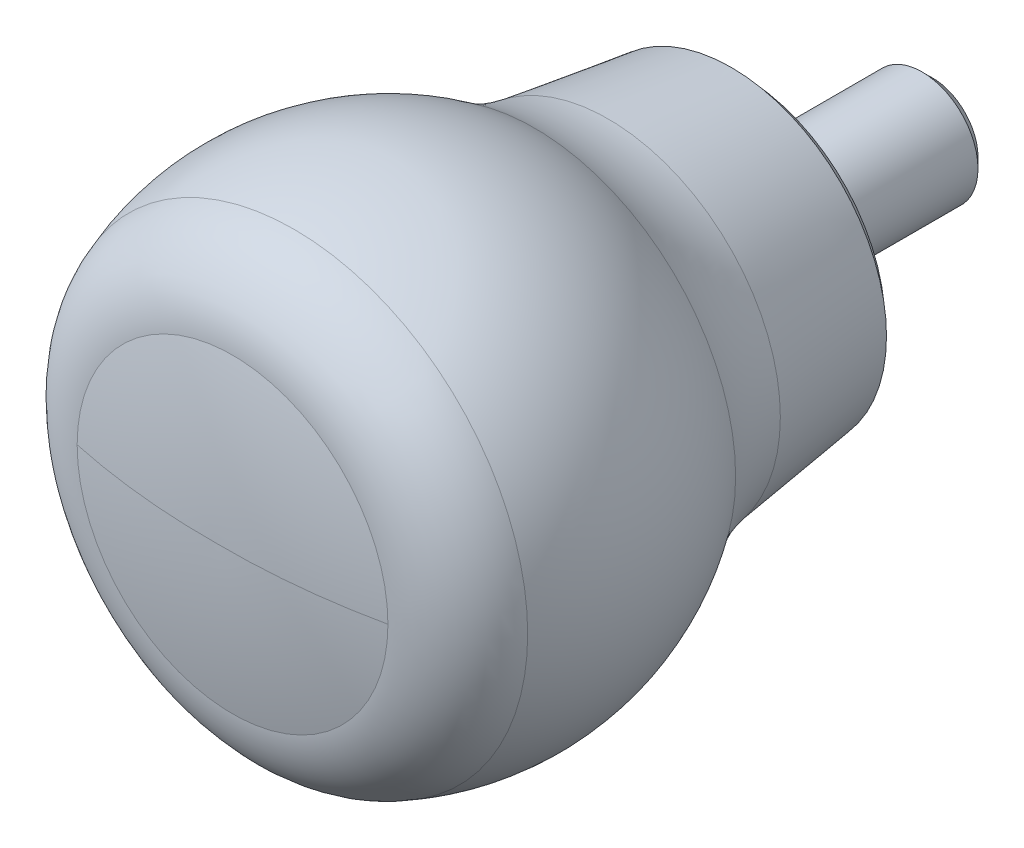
ISO-10303-21;
HEADER;
FILE_DESCRIPTION(('STEP AP214'),'2;1');
FILE_NAME('part.step','',(''),(''),'','','');
FILE_SCHEMA(('AUTOMOTIVE_DESIGN { 1 0 10303 214 1 1 1 1 }'));
ENDSEC;
DATA;
#1=APPLICATION_CONTEXT('core data for automotive mechanical design processes');
#2=APPLICATION_PROTOCOL_DEFINITION('international standard','automotive_design',2000,#1);
#3=PRODUCT_CONTEXT('',#1,'mechanical');
#4=PRODUCT('Part','Part','',(#3));
#5=PRODUCT_RELATED_PRODUCT_CATEGORY('part','',(#4));
#6=PRODUCT_DEFINITION_FORMATION('','',#4);
#7=PRODUCT_DEFINITION_CONTEXT('part definition',#1,'design');
#8=PRODUCT_DEFINITION('design','',#6,#7);
#9=PRODUCT_DEFINITION_SHAPE('','',#8);
#10=(LENGTH_UNIT() NAMED_UNIT(*) SI_UNIT(.MILLI.,.METRE.));
#11=(NAMED_UNIT(*) PLANE_ANGLE_UNIT() SI_UNIT($,.RADIAN.));
#12=(NAMED_UNIT(*) SI_UNIT($,.STERADIAN.) SOLID_ANGLE_UNIT());
#13=UNCERTAINTY_MEASURE_WITH_UNIT(LENGTH_MEASURE(1.E-05),#10,'distance_accuracy_value','');
#14=(GEOMETRIC_REPRESENTATION_CONTEXT(3) GLOBAL_UNCERTAINTY_ASSIGNED_CONTEXT((#13)) GLOBAL_UNIT_ASSIGNED_CONTEXT((#10,
#11,#12)) REPRESENTATION_CONTEXT('',''));
#15=CARTESIAN_POINT('',(0.,0.,0.));
#16=DIRECTION('',(0.,0.,1.));
#17=DIRECTION('',(1.,0.,0.));
#18=AXIS2_PLACEMENT_3D('',#15,#16,#17);
#19=CARTESIAN_POINT('',(0.,2.04,-17.));
#20=DIRECTION('',(0.,0.,-1.));
#21=DIRECTION('',(-1.,0.,0.));
#22=AXIS2_PLACEMENT_3D('',#19,#20,#21);
#23=PLANE('',#22);
#24=DIRECTION('',(0.866025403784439,0.5,0.));
#25=VECTOR('',#24,1.);
#26=CARTESIAN_POINT('',(-2.5,1.4433756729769,-17.));
#27=LINE('',#26,#25);
#28=CARTESIAN_POINT('',(-2.5,1.4433756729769,-17.));
#29=VERTEX_POINT('',#28);
#30=CARTESIAN_POINT('',(0.,2.88675134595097,-17.));
#31=VERTEX_POINT('',#30);
#32=EDGE_CURVE('E30',#29,#31,#27,.T.);
#33=ORIENTED_EDGE('',*,*,#32,.F.);
#34=DIRECTION('',(0.,1.,0.));
#35=VECTOR('',#34,1.);
#36=CARTESIAN_POINT('',(-2.5,-1.44337567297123,-17.));
#37=LINE('',#36,#35);
#38=CARTESIAN_POINT('',(-2.5,-1.44337567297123,-17.));
#39=VERTEX_POINT('',#38);
#40=EDGE_CURVE('E129',#39,#29,#37,.T.);
#41=ORIENTED_EDGE('',*,*,#40,.F.);
#42=DIRECTION('',(-0.866025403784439,0.5,0.));
#43=VECTOR('',#42,1.);
#44=CARTESIAN_POINT('',(0.,-2.88675134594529,-17.));
#45=LINE('',#44,#43);
#46=CARTESIAN_POINT('',(0.,-2.88675134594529,-17.));
#47=VERTEX_POINT('',#46);
#48=EDGE_CURVE('E127',#47,#39,#45,.T.);
#49=ORIENTED_EDGE('',*,*,#48,.F.);
#50=DIRECTION('',(-0.866025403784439,-0.5,0.));
#51=VECTOR('',#50,1.);
#52=CARTESIAN_POINT('',(2.5,-1.44337567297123,-17.));
#53=LINE('',#52,#51);
#54=CARTESIAN_POINT('',(2.5,-1.44337567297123,-17.));
#55=VERTEX_POINT('',#54);
#56=EDGE_CURVE('E96',#55,#47,#53,.T.);
#57=ORIENTED_EDGE('',*,*,#56,.F.);
#58=DIRECTION('',(0.,-1.,0.));
#59=VECTOR('',#58,1.);
#60=CARTESIAN_POINT('',(2.5,1.4433756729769,-17.));
#61=LINE('',#60,#59);
#62=CARTESIAN_POINT('',(2.5,1.4433756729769,-17.));
#63=VERTEX_POINT('',#62);
#64=EDGE_CURVE('E123',#63,#55,#61,.T.);
#65=ORIENTED_EDGE('',*,*,#64,.F.);
#66=DIRECTION('',(0.866025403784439,-0.5,0.));
#67=VECTOR('',#66,1.);
#68=CARTESIAN_POINT('',(0.,2.88675134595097,-17.));
#69=LINE('',#68,#67);
#70=EDGE_CURVE('E120',#31,#63,#69,.T.);
#71=ORIENTED_EDGE('',*,*,#70,.F.);
#72=EDGE_LOOP('',(#33,#41,#49,#57,#65,#71));
#73=FACE_BOUND('',#72,.T.);
#74=CARTESIAN_POINT('',(0.,0.,-17.));
#75=DIRECTION('',(0.,0.,1.));
#76=DIRECTION('',(1.,0.,0.));
#77=AXIS2_PLACEMENT_3D('',#74,#75,#76);
#78=CIRCLE('',#77,4.08000000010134);
#79=CARTESIAN_POINT('',(4.08000000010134,0.,-17.));
#80=VERTEX_POINT('',#79);
#81=EDGE_CURVE('E17',#80,#80,#78,.T.);
#82=ORIENTED_EDGE('',*,*,#81,.F.);
#83=EDGE_LOOP('',(#82));
#84=FACE_BOUND('',#83,.T.);
#85=ADVANCED_FACE('F14',(#73,#84),#23,.T.);
#86=CARTESIAN_POINT('',(0.,0.,-16.0800000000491));
#87=DIRECTION('',(0.,0.,1.));
#88=DIRECTION('',(1.,0.,0.));
#89=AXIS2_PLACEMENT_3D('',#86,#87,#88);
#90=CONICAL_SURFACE('',#89,5.0000000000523,0.785398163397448);
#91=ORIENTED_EDGE('',*,*,#81,.T.);
#92=EDGE_LOOP('',(#91));
#93=FACE_BOUND('',#92,.T.);
#94=CARTESIAN_POINT('',(0.,0.,-16.08));
#95=DIRECTION('',(0.,0.,1.));
#96=DIRECTION('',(1.,0.,0.));
#97=AXIS2_PLACEMENT_3D('',#94,#95,#96);
#98=CIRCLE('',#97,5.);
#99=CARTESIAN_POINT('',(5.,0.,-16.08));
#100=VERTEX_POINT('',#99);
#101=EDGE_CURVE('E198',#100,#100,#98,.T.);
#102=ORIENTED_EDGE('',*,*,#101,.F.);
#103=EDGE_LOOP('',(#102));
#104=FACE_BOUND('',#103,.T.);
#105=ADVANCED_FACE('F223',(#93,#104),#90,.T.);
#106=CARTESIAN_POINT('',(0.,0.,-9.5));
#107=DIRECTION('',(0.,0.,1.));
#108=DIRECTION('',(1.,0.,0.));
#109=AXIS2_PLACEMENT_3D('',#106,#107,#108);
#110=CYLINDRICAL_SURFACE('',#109,5.);
#111=ORIENTED_EDGE('',*,*,#101,.T.);
#112=EDGE_LOOP('',(#111));
#113=FACE_BOUND('',#112,.T.);
#114=CARTESIAN_POINT('',(0.,0.,-2.91999999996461));
#115=DIRECTION('',(0.,0.,-1.));
#116=DIRECTION('',(0.,1.,0.));
#117=AXIS2_PLACEMENT_3D('',#114,#115,#116);
#118=CIRCLE('',#117,4.99999999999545);
#119=CARTESIAN_POINT('',(0.,4.99999999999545,-2.91999999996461));
#120=VERTEX_POINT('',#119);
#121=EDGE_CURVE('E195',#120,#120,#118,.F.);
#122=ORIENTED_EDGE('',*,*,#121,.F.);
#123=EDGE_LOOP('',(#122));
#124=FACE_BOUND('',#123,.T.);
#125=ADVANCED_FACE('F218',(#113,#124),#110,.T.);
#126=CARTESIAN_POINT('',(0.,0.,-2.91999999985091));
#127=DIRECTION('',(0.,0.,-1.));
#128=DIRECTION('',(-1.,0.,0.));
#129=AXIS2_PLACEMENT_3D('',#126,#127,#128);
#130=CONICAL_SURFACE('',#129,4.99999999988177,0.785398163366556);
#131=ORIENTED_EDGE('',*,*,#121,.T.);
#132=EDGE_LOOP('',(#131));
#133=FACE_BOUND('',#132,.T.);
#134=CARTESIAN_POINT('',(0.,0.,-2.));
#135=DIRECTION('',(0.,0.,1.));
#136=DIRECTION('',(1.,0.,0.));
#137=AXIS2_PLACEMENT_3D('',#134,#135,#136);
#138=CIRCLE('',#137,4.08);
#139=CARTESIAN_POINT('',(4.08,0.,-2.));
#140=VERTEX_POINT('',#139);
#141=EDGE_CURVE('E191',#140,#140,#138,.T.);
#142=ORIENTED_EDGE('',*,*,#141,.F.);
#143=EDGE_LOOP('',(#142));
#144=FACE_BOUND('',#143,.T.);
#145=ADVANCED_FACE('F209',(#133,#144),#130,.T.);
#146=CARTESIAN_POINT('',(0.,0.,-1.));
#147=DIRECTION('',(0.,0.,1.));
#148=DIRECTION('',(1.,0.,0.));
#149=AXIS2_PLACEMENT_3D('',#146,#147,#148);
#150=CYLINDRICAL_SURFACE('',#149,4.08);
#151=ORIENTED_EDGE('',*,*,#141,.T.);
#152=EDGE_LOOP('',(#151));
#153=FACE_BOUND('',#152,.T.);
#154=CARTESIAN_POINT('',(0.,0.,0.));
#155=DIRECTION('',(0.,0.,1.));
#156=DIRECTION('',(1.,0.,0.));
#157=AXIS2_PLACEMENT_3D('',#154,#155,#156);
#158=CIRCLE('',#157,4.08);
#159=CARTESIAN_POINT('',(4.08,0.,0.));
#160=VERTEX_POINT('',#159);
#161=EDGE_CURVE('E194',#160,#160,#158,.T.);
#162=ORIENTED_EDGE('',*,*,#161,.F.);
#163=EDGE_LOOP('',(#162));
#164=FACE_BOUND('',#163,.T.);
#165=ADVANCED_FACE('F207',(#153,#164),#150,.T.);
#166=CARTESIAN_POINT('',(0.,8.415,0.));
#167=DIRECTION('',(0.,0.,-1.));
#168=DIRECTION('',(-1.,0.,0.));
#169=AXIS2_PLACEMENT_3D('',#166,#167,#168);
#170=PLANE('',#169);
#171=CARTESIAN_POINT('',(0.,0.,0.));
#172=DIRECTION('',(0.,0.,1.));
#173=DIRECTION('',(1.,0.,0.));
#174=AXIS2_PLACEMENT_3D('',#171,#172,#173);
#175=CIRCLE('',#174,12.75);
#176=CARTESIAN_POINT('',(12.75,0.,0.));
#177=VERTEX_POINT('',#176);
#178=EDGE_CURVE('E201',#177,#177,#175,.T.);
#179=ORIENTED_EDGE('',*,*,#178,.F.);
#180=EDGE_LOOP('',(#179));
#181=FACE_BOUND('',#180,.T.);
#182=ORIENTED_EDGE('',*,*,#161,.T.);
#183=EDGE_LOOP('',(#182));
#184=FACE_BOUND('',#183,.T.);
#185=ADVANCED_FACE('F185',(#181,#184),#170,.T.);
#186=CARTESIAN_POINT('',(-0.635212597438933,0.,-16.3968177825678));
#187=DIRECTION('',(0.,1.,0.));
#188=DIRECTION('',(-1.,0.,0.));
#189=AXIS2_PLACEMENT_3D('',#186,#187,#188);
#190=CIRCLE('',#189,63.4);
#191=TRIMMED_CURVE('',#190,(PARAMETER_VALUE(-1.58081562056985)),
(PARAMETER_VALUE(1.58081562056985)),.T.,.PARAMETER.);
#192=CARTESIAN_POINT('',(0.,0.,-16.3968177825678));
#193=DIRECTION('',(0.,0.,-1.));
#194=AXIS1_PLACEMENT('',#192,#193);
#195=SURFACE_OF_REVOLUTION('',#191,#194);
#196=CARTESIAN_POINT('',(-0.635212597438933,0.,-16.3968177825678));
#197=DIRECTION('',(0.,1.,0.));
#198=DIRECTION('',(-1.,0.,0.));
#199=AXIS2_PLACEMENT_3D('',#196,#197,#198);
#200=CIRCLE('',#199,63.4);
#201=CARTESIAN_POINT('',(-13.9,0.,45.6));
#202=VERTEX_POINT('',#201);
#203=CARTESIAN_POINT('',(0.,2.83829810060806E-12,47.));
#204=VERTEX_POINT('',#203);
#205=EDGE_CURVE('E167',#202,#204,#200,.T.);
#206=ORIENTED_EDGE('',*,*,#205,.F.);
#207=CARTESIAN_POINT('',(0.,0.,45.6));
#208=DIRECTION('',(0.,0.,-1.));
#209=DIRECTION('',(-1.,0.,0.));
#210=AXIS2_PLACEMENT_3D('',#207,#208,#209);
#211=CIRCLE('',#210,13.9);
#212=CARTESIAN_POINT('',(13.9,6.21097320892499E-11,45.6));
#213=VERTEX_POINT('',#212);
#214=EDGE_CURVE('E39',#213,#202,#211,.T.);
#215=ORIENTED_EDGE('',*,*,#214,.F.);
#216=CARTESIAN_POINT('',(0.635212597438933,1.13531146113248E-11,-16.3968177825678));
#217=DIRECTION('',(1.78729368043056E-11,-1.,0.));
#218=DIRECTION('',(1.,1.78729368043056E-11,0.));
#219=AXIS2_PLACEMENT_3D('',#216,#217,#218);
#220=CIRCLE('',#219,63.4);
#221=EDGE_CURVE('E48',#204,#213,#220,.F.);
#222=ORIENTED_EDGE('',*,*,#221,.F.);
#223=EDGE_LOOP('',(#206,#215,#222));
#224=FACE_BOUND('',#223,.T.);
#225=ADVANCED_FACE('F180',(#224),#195,.F.);
#226=CARTESIAN_POINT('',(0.,0.,0.99067883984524));
#227=DIRECTION('',(0.,0.,1.));
#228=DIRECTION('',(1.,0.,0.));
#229=AXIS2_PLACEMENT_3D('',#226,#227,#228);
#230=CONICAL_SURFACE('',#229,13.8862183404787,0.853719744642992);
#231=CARTESIAN_POINT('',(0.,0.,0.990678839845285));
#232=DIRECTION('',(0.,0.,1.));
#233=DIRECTION('',(0.,1.,0.));
#234=AXIS2_PLACEMENT_3D('',#231,#232,#233);
#235=CIRCLE('',#234,13.8862183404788);
#236=CARTESIAN_POINT('',(0.,13.8862183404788,0.990678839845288));
#237=VERTEX_POINT('',#236);
#238=EDGE_CURVE('E165',#237,#237,#235,.T.);
#239=ORIENTED_EDGE('',*,*,#238,.F.);
#240=EDGE_LOOP('',(#239));
#241=FACE_BOUND('',#240,.T.);
#242=ORIENTED_EDGE('',*,*,#178,.T.);
#243=EDGE_LOOP('',(#242));
#244=FACE_BOUND('',#243,.T.);
#245=ADVANCED_FACE('F176',(#241,#244),#230,.T.);
#246=CARTESIAN_POINT('',(-0.635212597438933,0.,-16.3968177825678));
#247=DIRECTION('',(0.,1.,0.));
#248=DIRECTION('',(-1.,0.,0.));
#249=AXIS2_PLACEMENT_3D('',#246,#247,#248);
#250=CIRCLE('',#249,63.4);
#251=TRIMMED_CURVE('',#250,(PARAMETER_VALUE(-1.58081562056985)),
(PARAMETER_VALUE(1.58081562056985)),.T.,.PARAMETER.);
#252=CARTESIAN_POINT('',(0.,0.,-16.3968177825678));
#253=DIRECTION('',(0.,0.,-1.));
#254=AXIS1_PLACEMENT('',#252,#253);
#255=SURFACE_OF_REVOLUTION('',#251,#254);
#256=CARTESIAN_POINT('',(0.,0.,45.6));
#257=DIRECTION('',(0.,0.,-1.));
#258=DIRECTION('',(-1.,0.,0.));
#259=AXIS2_PLACEMENT_3D('',#256,#257,#258);
#260=CIRCLE('',#259,13.9);
#261=EDGE_CURVE('E160',#202,#213,#260,.T.);
#262=ORIENTED_EDGE('',*,*,#261,.F.);
#263=ORIENTED_EDGE('',*,*,#205,.T.);
#264=ORIENTED_EDGE('',*,*,#221,.T.);
#265=EDGE_LOOP('',(#262,#263,#264));
#266=FACE_BOUND('',#265,.T.);
#267=ADVANCED_FACE('F172',(#266),#255,.F.);
#268=CARTESIAN_POINT('',(0.,0.,12.));
#269=DIRECTION('',(0.,0.,1.));
#270=DIRECTION('',(1.,0.,0.));
#271=AXIS2_PLACEMENT_3D('',#268,#269,#270);
#272=CONICAL_SURFACE('',#271,15.4,0.136643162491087);
#273=CARTESIAN_POINT('',(0.,0.,12.));
#274=DIRECTION('',(0.,0.,-1.));
#275=DIRECTION('',(-1.,0.,0.));
#276=AXIS2_PLACEMENT_3D('',#273,#274,#275);
#277=CIRCLE('',#276,15.4);
#278=CARTESIAN_POINT('',(-15.4,0.,12.));
#279=VERTEX_POINT('',#278);
#280=EDGE_CURVE('E158',#279,#279,#277,.T.);
#281=ORIENTED_EDGE('',*,*,#280,.T.);
#282=EDGE_LOOP('',(#281));
#283=FACE_BOUND('',#282,.T.);
#284=ORIENTED_EDGE('',*,*,#238,.T.);
#285=EDGE_LOOP('',(#284));
#286=FACE_BOUND('',#285,.T.);
#287=ADVANCED_FACE('F175',(#283,#286),#272,.T.);
#288=CARTESIAN_POINT('',(0.,0.,37.8134177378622));
#289=DIRECTION('',(0.,0.,-1.));
#290=DIRECTION('',(-1.,0.,0.));
#291=AXIS2_PLACEMENT_3D('',#288,#289,#290);
#292=TOROIDAL_SURFACE('',#291,13.4426853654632,7.8);
#293=CARTESIAN_POINT('',(0.,0.,40.1));
#294=DIRECTION('',(0.,0.,-1.));
#295=DIRECTION('',(-1.,0.,0.));
#296=AXIS2_PLACEMENT_3D('',#293,#294,#295);
#297=CIRCLE('',#296,20.9);
#298=CARTESIAN_POINT('',(-20.9,0.,40.1));
#299=VERTEX_POINT('',#298);
#300=EDGE_CURVE('E22',#299,#299,#297,.T.);
#301=ORIENTED_EDGE('',*,*,#300,.F.);
#302=EDGE_LOOP('',(#301));
#303=FACE_BOUND('',#302,.T.);
#304=ORIENTED_EDGE('',*,*,#261,.T.);
#305=ORIENTED_EDGE('',*,*,#214,.T.);
#306=EDGE_LOOP('',(#304,#305));
#307=FACE_BOUND('',#306,.T.);
#308=ADVANCED_FACE('F152',(#303,#307),#292,.T.);
#309=CARTESIAN_POINT('',(0.,0.,9.3561971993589));
#310=DIRECTION('',(0.,0.,-1.));
#311=DIRECTION('',(-1.,0.,0.));
#312=AXIS2_PLACEMENT_3D('',#309,#310,#311);
#313=TOROIDAL_SURFACE('',#312,31.7881148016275,16.6);
#314=CARTESIAN_POINT('',(0.,0.,18.6));
#315=DIRECTION('',(0.,0.,-1.));
#316=DIRECTION('',(-1.,0.,0.));
#317=AXIS2_PLACEMENT_3D('',#314,#315,#316);
#318=CIRCLE('',#317,18.);
#319=CARTESIAN_POINT('',(-18.,0.,18.6));
#320=VERTEX_POINT('',#319);
#321=EDGE_CURVE('E9',#320,#320,#318,.F.);
#322=ORIENTED_EDGE('',*,*,#321,.F.);
#323=EDGE_LOOP('',(#322));
#324=FACE_BOUND('',#323,.T.);
#325=ORIENTED_EDGE('',*,*,#280,.F.);
#326=EDGE_LOOP('',(#325));
#327=FACE_BOUND('',#326,.T.);
#328=ADVANCED_FACE('F146',(#324,#327),#313,.F.);
#329=CARTESIAN_POINT('',(1.1120257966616,0.,32.1234825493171));
#330=DIRECTION('',(0.,1.,0.));
#331=DIRECTION('',(-1.,0.,0.));
#332=AXIS2_PLACEMENT_3D('',#329,#330,#331);
#333=CIRCLE('',#332,23.4126912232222);
#334=TRIMMED_CURVE('',#333,(PARAMETER_VALUE(-1.52328174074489)),
(PARAMETER_VALUE(1.52328174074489)),.T.,.PARAMETER.);
#335=CARTESIAN_POINT('',(0.,0.,32.1234825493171));
#336=DIRECTION('',(0.,0.,-1.));
#337=AXIS1_PLACEMENT('',#335,#336);
#338=SURFACE_OF_REVOLUTION('',#334,#337);
#339=ORIENTED_EDGE('',*,*,#321,.T.);
#340=EDGE_LOOP('',(#339));
#341=FACE_BOUND('',#340,.T.);
#342=ORIENTED_EDGE('',*,*,#300,.T.);
#343=EDGE_LOOP('',(#342));
#344=FACE_BOUND('',#343,.T.);
#345=ADVANCED_FACE('F141',(#341,#344),#338,.F.);
#346=CARTESIAN_POINT('',(-2.5,1.4433756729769,-12.75));
#347=DIRECTION('',(-0.5,0.866025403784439,0.));
#348=DIRECTION('',(-0.866025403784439,-0.5,0.));
#349=AXIS2_PLACEMENT_3D('',#346,#347,#348);
#350=PLANE('',#349);
#351=ORIENTED_EDGE('',*,*,#32,.T.);
#352=DIRECTION('',(0.,0.,-1.));
#353=VECTOR('',#352,1.);
#354=CARTESIAN_POINT('',(0.,2.88675134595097,-12.75));
#355=LINE('',#354,#353);
#356=CARTESIAN_POINT('',(0.,2.88675134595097,-12.75));
#357=VERTEX_POINT('',#356);
#358=EDGE_CURVE('E78',#357,#31,#355,.T.);
#359=ORIENTED_EDGE('',*,*,#358,.F.);
#360=DIRECTION('',(0.866025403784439,0.5,0.));
#361=VECTOR('',#360,1.);
#362=CARTESIAN_POINT('',(-2.5,1.4433756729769,-12.75));
#363=LINE('',#362,#361);
#364=CARTESIAN_POINT('',(-2.5,1.4433756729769,-12.75));
#365=VERTEX_POINT('',#364);
#366=EDGE_CURVE('E131',#365,#357,#363,.T.);
#367=ORIENTED_EDGE('',*,*,#366,.F.);
#368=DIRECTION('',(0.,0.,-1.));
#369=VECTOR('',#368,1.);
#370=CARTESIAN_POINT('',(-2.5,1.4433756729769,-12.75));
#371=LINE('',#370,#369);
#372=EDGE_CURVE('E56',#365,#29,#371,.T.);
#373=ORIENTED_EDGE('',*,*,#372,.T.);
#374=EDGE_LOOP('',(#351,#359,#367,#373));
#375=FACE_BOUND('',#374,.T.);
#376=ADVANCED_FACE('F145',(#375),#350,.F.);
#377=CARTESIAN_POINT('',(-2.5,-1.44337567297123,-12.75));
#378=DIRECTION('',(-1.,0.,0.));
#379=DIRECTION('',(0.,0.,1.));
#380=AXIS2_PLACEMENT_3D('',#377,#378,#379);
#381=PLANE('',#380);
#382=ORIENTED_EDGE('',*,*,#40,.T.);
#383=ORIENTED_EDGE('',*,*,#372,.F.);
#384=DIRECTION('',(0.,1.,0.));
#385=VECTOR('',#384,1.);
#386=CARTESIAN_POINT('',(-2.5,-1.44337567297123,-12.75));
#387=LINE('',#386,#385);
#388=CARTESIAN_POINT('',(-2.5,-1.44337567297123,-12.75));
#389=VERTEX_POINT('',#388);
#390=EDGE_CURVE('E106',#389,#365,#387,.T.);
#391=ORIENTED_EDGE('',*,*,#390,.F.);
#392=DIRECTION('',(0.,0.,-1.));
#393=VECTOR('',#392,1.);
#394=CARTESIAN_POINT('',(-2.5,-1.44337567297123,-12.75));
#395=LINE('',#394,#393);
#396=EDGE_CURVE('E73',#389,#39,#395,.T.);
#397=ORIENTED_EDGE('',*,*,#396,.T.);
#398=EDGE_LOOP('',(#382,#383,#391,#397));
#399=FACE_BOUND('',#398,.T.);
#400=ADVANCED_FACE('F245',(#399),#381,.F.);
#401=CARTESIAN_POINT('',(0.,-2.88675134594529,-12.75));
#402=DIRECTION('',(-0.5,-0.866025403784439,0.));
#403=DIRECTION('',(0.866025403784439,-0.5,0.));
#404=AXIS2_PLACEMENT_3D('',#401,#402,#403);
#405=PLANE('',#404);
#406=ORIENTED_EDGE('',*,*,#48,.T.);
#407=ORIENTED_EDGE('',*,*,#396,.F.);
#408=DIRECTION('',(-0.866025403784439,0.5,0.));
#409=VECTOR('',#408,1.);
#410=CARTESIAN_POINT('',(0.,-2.88675134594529,-12.75));
#411=LINE('',#410,#409);
#412=CARTESIAN_POINT('',(0.,-2.88675134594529,-12.75));
#413=VERTEX_POINT('',#412);
#414=EDGE_CURVE('E102',#413,#389,#411,.T.);
#415=ORIENTED_EDGE('',*,*,#414,.F.);
#416=DIRECTION('',(0.,0.,-1.));
#417=VECTOR('',#416,1.);
#418=CARTESIAN_POINT('',(0.,-2.88675134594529,-12.75));
#419=LINE('',#418,#417);
#420=EDGE_CURVE('E89',#413,#47,#419,.T.);
#421=ORIENTED_EDGE('',*,*,#420,.T.);
#422=EDGE_LOOP('',(#406,#407,#415,#421));
#423=FACE_BOUND('',#422,.T.);
#424=ADVANCED_FACE('F103',(#423),#405,.F.);
#425=CARTESIAN_POINT('',(2.5,-1.44337567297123,-12.75));
#426=DIRECTION('',(0.5,-0.866025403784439,0.));
#427=DIRECTION('',(0.866025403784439,0.5,0.));
#428=AXIS2_PLACEMENT_3D('',#425,#426,#427);
#429=PLANE('',#428);
#430=ORIENTED_EDGE('',*,*,#56,.T.);
#431=ORIENTED_EDGE('',*,*,#420,.F.);
#432=DIRECTION('',(-0.866025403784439,-0.5,0.));
#433=VECTOR('',#432,1.);
#434=CARTESIAN_POINT('',(2.5,-1.44337567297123,-12.75));
#435=LINE('',#434,#433);
#436=CARTESIAN_POINT('',(2.5,-1.44337567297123,-12.75));
#437=VERTEX_POINT('',#436);
#438=EDGE_CURVE('E93',#437,#413,#435,.T.);
#439=ORIENTED_EDGE('',*,*,#438,.F.);
#440=DIRECTION('',(0.,0.,-1.));
#441=VECTOR('',#440,1.);
#442=CARTESIAN_POINT('',(2.5,-1.44337567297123,-12.75));
#443=LINE('',#442,#441);
#444=EDGE_CURVE('E99',#437,#55,#443,.T.);
#445=ORIENTED_EDGE('',*,*,#444,.T.);
#446=EDGE_LOOP('',(#430,#431,#439,#445));
#447=FACE_BOUND('',#446,.T.);
#448=ADVANCED_FACE('F91',(#447),#429,.F.);
#449=CARTESIAN_POINT('',(2.5,1.4433756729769,-12.75));
#450=DIRECTION('',(1.,0.,0.));
#451=DIRECTION('',(0.,1.,0.));
#452=AXIS2_PLACEMENT_3D('',#449,#450,#451);
#453=PLANE('',#452);
#454=ORIENTED_EDGE('',*,*,#64,.T.);
#455=ORIENTED_EDGE('',*,*,#444,.F.);
#456=DIRECTION('',(0.,-1.,0.));
#457=VECTOR('',#456,1.);
#458=CARTESIAN_POINT('',(2.5,1.4433756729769,-12.75));
#459=LINE('',#458,#457);
#460=CARTESIAN_POINT('',(2.5,1.4433756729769,-12.75));
#461=VERTEX_POINT('',#460);
#462=EDGE_CURVE('E112',#461,#437,#459,.T.);
#463=ORIENTED_EDGE('',*,*,#462,.F.);
#464=DIRECTION('',(0.,0.,-1.));
#465=VECTOR('',#464,1.);
#466=CARTESIAN_POINT('',(2.5,1.4433756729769,-12.75));
#467=LINE('',#466,#465);
#468=EDGE_CURVE('E135',#461,#63,#467,.T.);
#469=ORIENTED_EDGE('',*,*,#468,.T.);
#470=EDGE_LOOP('',(#454,#455,#463,#469));
#471=FACE_BOUND('',#470,.T.);
#472=ADVANCED_FACE('F260',(#471),#453,.F.);
#473=CARTESIAN_POINT('',(0.,2.88675134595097,-12.75));
#474=DIRECTION('',(0.5,0.866025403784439,0.));
#475=DIRECTION('',(-0.866025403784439,0.5,0.));
#476=AXIS2_PLACEMENT_3D('',#473,#474,#475);
#477=PLANE('',#476);
#478=ORIENTED_EDGE('',*,*,#70,.T.);
#479=ORIENTED_EDGE('',*,*,#468,.F.);
#480=DIRECTION('',(0.866025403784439,-0.5,0.));
#481=VECTOR('',#480,1.);
#482=CARTESIAN_POINT('',(0.,2.88675134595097,-12.75));
#483=LINE('',#482,#481);
#484=EDGE_CURVE('E114',#357,#461,#483,.T.);
#485=ORIENTED_EDGE('',*,*,#484,.F.);
#486=ORIENTED_EDGE('',*,*,#358,.T.);
#487=EDGE_LOOP('',(#478,#479,#485,#486));
#488=FACE_BOUND('',#487,.T.);
#489=ADVANCED_FACE('F262',(#488),#477,.F.);
#490=CARTESIAN_POINT('',(0.,2.88675134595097,-12.75));
#491=DIRECTION('',(0.,0.,-1.));
#492=DIRECTION('',(-1.,0.,0.));
#493=AXIS2_PLACEMENT_3D('',#490,#491,#492);
#494=PLANE('',#493);
#495=ORIENTED_EDGE('',*,*,#366,.T.);
#496=ORIENTED_EDGE('',*,*,#484,.T.);
#497=ORIENTED_EDGE('',*,*,#462,.T.);
#498=ORIENTED_EDGE('',*,*,#438,.T.);
#499=ORIENTED_EDGE('',*,*,#414,.T.);
#500=ORIENTED_EDGE('',*,*,#390,.T.);
#501=EDGE_LOOP('',(#495,#496,#497,#498,#499,#500));
#502=FACE_BOUND('',#501,.T.);
#503=ADVANCED_FACE('F109',(#502),#494,.T.);
#504=CLOSED_SHELL('',(#85,#105,#125,#145,#165,#185,#225,#245,#267,#287,#308,#328,#345,#376,#400,
#424,#448,#472,#489,#503));
#505=MANIFOLD_SOLID_BREP('B1',#504);
#506=ADVANCED_BREP_SHAPE_REPRESENTATION('',(#18,#505),#14);
#507=SHAPE_DEFINITION_REPRESENTATION(#9,#506);
ENDSEC;
END-ISO-10303-21;
